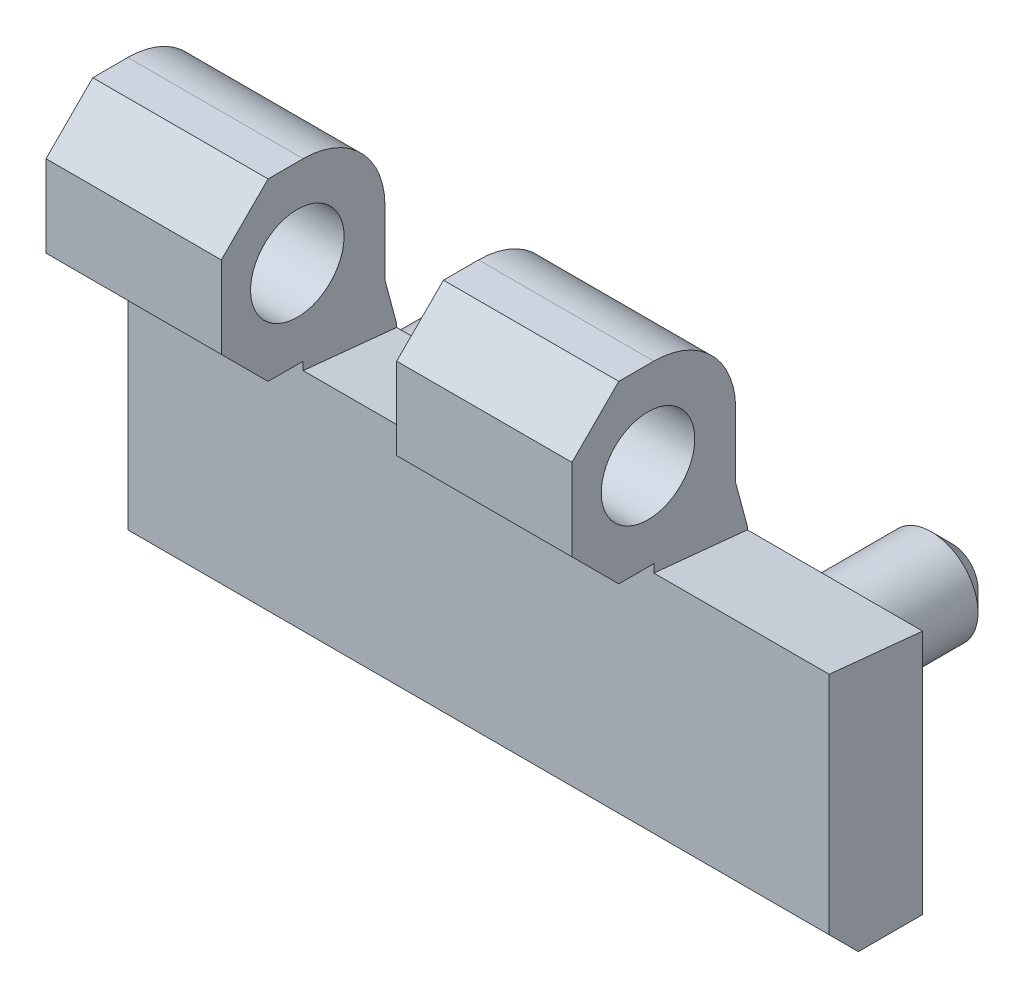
ISO-10303-21;
HEADER;
FILE_DESCRIPTION(('STEP AP214'),'2;1');
FILE_NAME('part.step','',(''),(''),'','','');
FILE_SCHEMA(('AUTOMOTIVE_DESIGN { 1 0 10303 214 1 1 1 1 }'));
ENDSEC;
DATA;
#1=APPLICATION_CONTEXT('core data for automotive mechanical design processes');
#2=APPLICATION_PROTOCOL_DEFINITION('international standard','automotive_design',2000,#1);
#3=PRODUCT_CONTEXT('',#1,'mechanical');
#4=PRODUCT('Part','Part','',(#3));
#5=PRODUCT_RELATED_PRODUCT_CATEGORY('part','',(#4));
#6=PRODUCT_DEFINITION_FORMATION('','',#4);
#7=PRODUCT_DEFINITION_CONTEXT('part definition',#1,'design');
#8=PRODUCT_DEFINITION('design','',#6,#7);
#9=PRODUCT_DEFINITION_SHAPE('','',#8);
#10=(LENGTH_UNIT() NAMED_UNIT(*) SI_UNIT(.MILLI.,.METRE.));
#11=(NAMED_UNIT(*) PLANE_ANGLE_UNIT() SI_UNIT($,.RADIAN.));
#12=(NAMED_UNIT(*) SI_UNIT($,.STERADIAN.) SOLID_ANGLE_UNIT());
#13=UNCERTAINTY_MEASURE_WITH_UNIT(LENGTH_MEASURE(1.E-05),#10,'distance_accuracy_value','');
#14=(GEOMETRIC_REPRESENTATION_CONTEXT(3) GLOBAL_UNCERTAINTY_ASSIGNED_CONTEXT((#13)) GLOBAL_UNIT_ASSIGNED_CONTEXT((#10,
#11,#12)) REPRESENTATION_CONTEXT('',''));
#15=CARTESIAN_POINT('',(0.,0.,0.));
#16=DIRECTION('',(0.,0.,1.));
#17=DIRECTION('',(1.,0.,0.));
#18=AXIS2_PLACEMENT_3D('',#15,#16,#17);
#19=CARTESIAN_POINT('',(-12.,9.,0.));
#20=DIRECTION('',(0.,0.995037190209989,-0.0995037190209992));
#21=DIRECTION('',(0.,0.0995037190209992,0.995037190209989));
#22=AXIS2_PLACEMENT_3D('',#19,#20,#21);
#23=PLANE('',#22);
#24=DIRECTION('',(0.,-0.0995037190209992,-0.995037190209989));
#25=VECTOR('',#24,1.);
#26=CARTESIAN_POINT('',(3.,9.,0.));
#27=LINE('',#26,#25);
#28=CARTESIAN_POINT('',(3.,9.8,8.));
#29=VERTEX_POINT('',#28);
#30=CARTESIAN_POINT('',(3.,9.,0.));
#31=VERTEX_POINT('',#30);
#32=EDGE_CURVE('E29',#29,#31,#27,.T.);
#33=ORIENTED_EDGE('',*,*,#32,.F.);
#34=DIRECTION('',(1.,0.,0.));
#35=VECTOR('',#34,1.);
#36=CARTESIAN_POINT('',(-12.,9.8,8.));
#37=LINE('',#36,#35);
#38=CARTESIAN_POINT('',(18.,9.8,8.));
#39=VERTEX_POINT('',#38);
#40=EDGE_CURVE('E403',#29,#39,#37,.T.);
#41=ORIENTED_EDGE('',*,*,#40,.T.);
#42=DIRECTION('',(0.,-0.0995037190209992,-0.995037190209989));
#43=VECTOR('',#42,1.);
#44=CARTESIAN_POINT('',(18.,9.,0.));
#45=LINE('',#44,#43);
#46=CARTESIAN_POINT('',(18.,9.,0.));
#47=VERTEX_POINT('',#46);
#48=EDGE_CURVE('E369',#39,#47,#45,.T.);
#49=ORIENTED_EDGE('',*,*,#48,.T.);
#50=DIRECTION('',(1.,0.,0.));
#51=VECTOR('',#50,1.);
#52=CARTESIAN_POINT('',(-12.,9.,0.));
#53=LINE('',#52,#51);
#54=EDGE_CURVE('E36',#31,#47,#53,.T.);
#55=ORIENTED_EDGE('',*,*,#54,.F.);
#56=EDGE_LOOP('',(#33,#41,#49,#55));
#57=FACE_BOUND('',#56,.T.);
#58=ADVANCED_FACE('F14',(#57),#23,.T.);
#59=CARTESIAN_POINT('',(-12.,-12.,5.5));
#60=DIRECTION('',(0.,-1.,0.));
#61=DIRECTION('',(1.,0.,0.));
#62=AXIS2_PLACEMENT_3D('',#59,#60,#61);
#63=PLANE('',#62);
#64=DIRECTION('',(1.,0.,0.));
#65=VECTOR('',#64,1.);
#66=CARTESIAN_POINT('',(-12.,-12.,0.));
#67=LINE('',#66,#65);
#68=CARTESIAN_POINT('',(-12.,-12.,0.));
#69=VERTEX_POINT('',#68);
#70=CARTESIAN_POINT('',(48.,-12.,0.));
#71=VERTEX_POINT('',#70);
#72=EDGE_CURVE('E407',#69,#71,#67,.T.);
#73=ORIENTED_EDGE('',*,*,#72,.T.);
#74=DIRECTION('',(0.,0.,-1.));
#75=VECTOR('',#74,1.);
#76=CARTESIAN_POINT('',(48.,-12.,5.5));
#77=LINE('',#76,#75);
#78=CARTESIAN_POINT('',(48.,-12.,5.5));
#79=VERTEX_POINT('',#78);
#80=EDGE_CURVE('E374',#79,#71,#77,.T.);
#81=ORIENTED_EDGE('',*,*,#80,.F.);
#82=DIRECTION('',(1.,0.,0.));
#83=VECTOR('',#82,1.);
#84=CARTESIAN_POINT('',(-12.,-12.,5.5));
#85=LINE('',#84,#83);
#86=CARTESIAN_POINT('',(-12.,-12.,5.5));
#87=VERTEX_POINT('',#86);
#88=EDGE_CURVE('E396',#87,#79,#85,.T.);
#89=ORIENTED_EDGE('',*,*,#88,.F.);
#90=DIRECTION('',(0.,0.,-1.));
#91=VECTOR('',#90,1.);
#92=CARTESIAN_POINT('',(-12.,-12.,5.5));
#93=LINE('',#92,#91);
#94=EDGE_CURVE('E387',#87,#69,#93,.T.);
#95=ORIENTED_EDGE('',*,*,#94,.T.);
#96=EDGE_LOOP('',(#73,#81,#89,#95));
#97=FACE_BOUND('',#96,.T.);
#98=ADVANCED_FACE('F16',(#97),#63,.T.);
#99=CARTESIAN_POINT('',(-12.,-12.,0.));
#100=DIRECTION('',(0.,0.,-1.));
#101=DIRECTION('',(-1.,0.,0.));
#102=AXIS2_PLACEMENT_3D('',#99,#100,#101);
#103=PLANE('',#102);
#104=CARTESIAN_POINT('',(0.,0.,0.));
#105=DIRECTION('',(0.,0.,-1.));
#106=DIRECTION('',(-1.,0.,0.));
#107=AXIS2_PLACEMENT_3D('',#104,#105,#106);
#108=CIRCLE('',#107,4.);
#109=CARTESIAN_POINT('',(-4.,0.,0.));
#110=VERTEX_POINT('',#109);
#111=EDGE_CURVE('E9',#110,#110,#108,.T.);
#112=ORIENTED_EDGE('',*,*,#111,.F.);
#113=EDGE_LOOP('',(#112));
#114=FACE_BOUND('',#113,.T.);
#115=CARTESIAN_POINT('',(36.,0.,0.));
#116=DIRECTION('',(0.,0.,-1.));
#117=DIRECTION('',(-1.,0.,0.));
#118=AXIS2_PLACEMENT_3D('',#115,#116,#117);
#119=CIRCLE('',#118,4.);
#120=CARTESIAN_POINT('',(32.,0.,0.));
#121=VERTEX_POINT('',#120);
#122=EDGE_CURVE('E22',#121,#121,#119,.T.);
#123=ORIENTED_EDGE('',*,*,#122,.F.);
#124=EDGE_LOOP('',(#123));
#125=FACE_BOUND('',#124,.T.);
#126=DIRECTION('',(0.,1.,0.));
#127=VECTOR('',#126,1.);
#128=CARTESIAN_POINT('',(-12.,-12.,0.));
#129=LINE('',#128,#127);
#130=CARTESIAN_POINT('',(-12.,9.2679491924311,0.));
#131=VERTEX_POINT('',#130);
#132=EDGE_CURVE('E194',#69,#131,#129,.T.);
#133=ORIENTED_EDGE('',*,*,#132,.T.);
#134=DIRECTION('',(1.,0.,0.));
#135=VECTOR('',#134,1.);
#136=CARTESIAN_POINT('',(-12.,9.2679491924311,0.));
#137=LINE('',#136,#135);
#138=CARTESIAN_POINT('',(3.,9.2679491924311,0.));
#139=VERTEX_POINT('',#138);
#140=EDGE_CURVE('E191',#131,#139,#137,.T.);
#141=ORIENTED_EDGE('',*,*,#140,.T.);
#142=DIRECTION('',(0.,1.,0.));
#143=VECTOR('',#142,1.);
#144=CARTESIAN_POINT('',(3.,2.,0.));
#145=LINE('',#144,#143);
#146=EDGE_CURVE('E180',#31,#139,#145,.T.);
#147=ORIENTED_EDGE('',*,*,#146,.F.);
#148=ORIENTED_EDGE('',*,*,#54,.T.);
#149=DIRECTION('',(0.,1.,0.));
#150=VECTOR('',#149,1.);
#151=CARTESIAN_POINT('',(18.,2.,0.));
#152=LINE('',#151,#150);
#153=CARTESIAN_POINT('',(18.,9.2679491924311,0.));
#154=VERTEX_POINT('',#153);
#155=EDGE_CURVE('E284',#47,#154,#152,.T.);
#156=ORIENTED_EDGE('',*,*,#155,.T.);
#157=DIRECTION('',(-1.,0.,0.));
#158=VECTOR('',#157,1.);
#159=CARTESIAN_POINT('',(33.,9.2679491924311,0.));
#160=LINE('',#159,#158);
#161=CARTESIAN_POINT('',(33.,9.2679491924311,0.));
#162=VERTEX_POINT('',#161);
#163=EDGE_CURVE('E366',#162,#154,#160,.T.);
#164=ORIENTED_EDGE('',*,*,#163,.F.);
#165=DIRECTION('',(0.,1.,0.));
#166=VECTOR('',#165,1.);
#167=CARTESIAN_POINT('',(33.,2.,0.));
#168=LINE('',#167,#166);
#169=CARTESIAN_POINT('',(33.,9.,0.));
#170=VERTEX_POINT('',#169);
#171=EDGE_CURVE('E319',#170,#162,#168,.T.);
#172=ORIENTED_EDGE('',*,*,#171,.F.);
#173=CARTESIAN_POINT('',(48.,9.,0.));
#174=VERTEX_POINT('',#173);
#175=EDGE_CURVE('E405',#170,#174,#53,.T.);
#176=ORIENTED_EDGE('',*,*,#175,.T.);
#177=DIRECTION('',(0.,1.,0.));
#178=VECTOR('',#177,1.);
#179=CARTESIAN_POINT('',(48.,-12.,0.));
#180=LINE('',#179,#178);
#181=EDGE_CURVE('E375',#71,#174,#180,.T.);
#182=ORIENTED_EDGE('',*,*,#181,.F.);
#183=ORIENTED_EDGE('',*,*,#72,.F.);
#184=EDGE_LOOP('',(#133,#141,#147,#148,#156,#164,#172,#176,#182,#183));
#185=FACE_BOUND('',#184,.T.);
#186=ADVANCED_FACE('F192',(#114,#125,#185),#103,.T.);
#187=DIRECTION('',(0.,-0.0995037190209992,-0.995037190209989));
#188=VECTOR('',#187,1.);
#189=CARTESIAN_POINT('',(33.,9.,0.));
#190=LINE('',#189,#188);
#191=CARTESIAN_POINT('',(33.,9.8,8.));
#192=VERTEX_POINT('',#191);
#193=EDGE_CURVE('E372',#192,#170,#190,.T.);
#194=ORIENTED_EDGE('',*,*,#193,.F.);
#195=CARTESIAN_POINT('',(48.,9.8,8.));
#196=VERTEX_POINT('',#195);
#197=EDGE_CURVE('E402',#192,#196,#37,.T.);
#198=ORIENTED_EDGE('',*,*,#197,.T.);
#199=DIRECTION('',(0.,0.0995037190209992,0.995037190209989));
#200=VECTOR('',#199,1.);
#201=CARTESIAN_POINT('',(48.,9.,0.));
#202=LINE('',#201,#200);
#203=EDGE_CURVE('E378',#174,#196,#202,.T.);
#204=ORIENTED_EDGE('',*,*,#203,.F.);
#205=ORIENTED_EDGE('',*,*,#175,.F.);
#206=EDGE_LOOP('',(#194,#198,#204,#205));
#207=FACE_BOUND('',#206,.T.);
#208=ADVANCED_FACE('F414',(#207),#23,.T.);
#209=CARTESIAN_POINT('',(-12.,9.8,8.));
#210=DIRECTION('',(0.,0.,1.));
#211=DIRECTION('',(1.,0.,0.));
#212=AXIS2_PLACEMENT_3D('',#209,#210,#211);
#213=PLANE('',#212);
#214=DIRECTION('',(0.,-1.,0.));
#215=VECTOR('',#214,1.);
#216=CARTESIAN_POINT('',(-12.,9.8,8.));
#217=LINE('',#216,#215);
#218=CARTESIAN_POINT('',(-12.,10.5,8.));
#219=VERTEX_POINT('',#218);
#220=CARTESIAN_POINT('',(-12.,-9.5,8.));
#221=VERTEX_POINT('',#220);
#222=EDGE_CURVE('E391',#219,#221,#217,.T.);
#223=ORIENTED_EDGE('',*,*,#222,.T.);
#224=DIRECTION('',(1.,0.,0.));
#225=VECTOR('',#224,1.);
#226=CARTESIAN_POINT('',(-12.,-9.5,8.));
#227=LINE('',#226,#225);
#228=CARTESIAN_POINT('',(48.,-9.5,8.));
#229=VERTEX_POINT('',#228);
#230=EDGE_CURVE('E400',#221,#229,#227,.T.);
#231=ORIENTED_EDGE('',*,*,#230,.T.);
#232=DIRECTION('',(0.,-1.,0.));
#233=VECTOR('',#232,1.);
#234=CARTESIAN_POINT('',(48.,9.8,8.));
#235=LINE('',#234,#233);
#236=EDGE_CURVE('E381',#196,#229,#235,.T.);
#237=ORIENTED_EDGE('',*,*,#236,.F.);
#238=ORIENTED_EDGE('',*,*,#197,.F.);
#239=DIRECTION('',(0.,-1.,0.));
#240=VECTOR('',#239,1.);
#241=CARTESIAN_POINT('',(33.,10.5,8.));
#242=LINE('',#241,#240);
#243=CARTESIAN_POINT('',(33.,10.5,8.));
#244=VERTEX_POINT('',#243);
#245=EDGE_CURVE('E337',#244,#192,#242,.T.);
#246=ORIENTED_EDGE('',*,*,#245,.F.);
#247=DIRECTION('',(-1.,0.,0.));
#248=VECTOR('',#247,1.);
#249=CARTESIAN_POINT('',(33.,10.5,8.));
#250=LINE('',#249,#248);
#251=CARTESIAN_POINT('',(18.,10.5,8.));
#252=VERTEX_POINT('',#251);
#253=EDGE_CURVE('E342',#244,#252,#250,.T.);
#254=ORIENTED_EDGE('',*,*,#253,.T.);
#255=DIRECTION('',(0.,-1.,0.));
#256=VECTOR('',#255,1.);
#257=CARTESIAN_POINT('',(18.,10.5,8.));
#258=LINE('',#257,#256);
#259=EDGE_CURVE('E311',#252,#39,#258,.T.);
#260=ORIENTED_EDGE('',*,*,#259,.T.);
#261=ORIENTED_EDGE('',*,*,#40,.F.);
#262=DIRECTION('',(0.,-1.,0.));
#263=VECTOR('',#262,1.);
#264=CARTESIAN_POINT('',(3.,10.5,8.));
#265=LINE('',#264,#263);
#266=CARTESIAN_POINT('',(3.,10.5,8.));
#267=VERTEX_POINT('',#266);
#268=EDGE_CURVE('E235',#267,#29,#265,.T.);
#269=ORIENTED_EDGE('',*,*,#268,.F.);
#270=DIRECTION('',(1.,0.,0.));
#271=VECTOR('',#270,1.);
#272=CARTESIAN_POINT('',(-12.,10.5,8.));
#273=LINE('',#272,#271);
#274=EDGE_CURVE('E268',#219,#267,#273,.T.);
#275=ORIENTED_EDGE('',*,*,#274,.F.);
#276=EDGE_LOOP('',(#223,#231,#237,#238,#246,#254,#260,#261,#269,#275));
#277=FACE_BOUND('',#276,.T.);
#278=ADVANCED_FACE('F422',(#277),#213,.T.);
#279=CARTESIAN_POINT('',(-12.,-9.5,8.));
#280=DIRECTION('',(0.,-0.707106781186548,0.707106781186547));
#281=DIRECTION('',(0.,-0.707106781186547,-0.707106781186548));
#282=AXIS2_PLACEMENT_3D('',#279,#280,#281);
#283=PLANE('',#282);
#284=ORIENTED_EDGE('',*,*,#88,.T.);
#285=DIRECTION('',(0.,-0.707106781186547,-0.707106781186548));
#286=VECTOR('',#285,1.);
#287=CARTESIAN_POINT('',(48.,-9.5,8.));
#288=LINE('',#287,#286);
#289=EDGE_CURVE('E384',#229,#79,#288,.T.);
#290=ORIENTED_EDGE('',*,*,#289,.F.);
#291=ORIENTED_EDGE('',*,*,#230,.F.);
#292=DIRECTION('',(0.,-0.707106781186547,-0.707106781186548));
#293=VECTOR('',#292,1.);
#294=CARTESIAN_POINT('',(-12.,-9.5,8.));
#295=LINE('',#294,#293);
#296=EDGE_CURVE('E393',#221,#87,#295,.T.);
#297=ORIENTED_EDGE('',*,*,#296,.T.);
#298=EDGE_LOOP('',(#284,#290,#291,#297));
#299=FACE_BOUND('',#298,.T.);
#300=ADVANCED_FACE('F434',(#299),#283,.T.);
#301=CARTESIAN_POINT('',(-12.,-12.,0.));
#302=DIRECTION('',(1.,0.,0.));
#303=DIRECTION('',(0.,1.,0.));
#304=AXIS2_PLACEMENT_3D('',#301,#302,#303);
#305=PLANE('',#304);
#306=ORIENTED_EDGE('',*,*,#296,.F.);
#307=ORIENTED_EDGE('',*,*,#222,.F.);
#308=DIRECTION('',(0.,0.,-1.));
#309=VECTOR('',#308,1.);
#310=CARTESIAN_POINT('',(-12.,10.5,11.));
#311=LINE('',#310,#309);
#312=CARTESIAN_POINT('',(-12.,10.5,11.));
#313=VERTEX_POINT('',#312);
#314=EDGE_CURVE('E262',#313,#219,#311,.T.);
#315=ORIENTED_EDGE('',*,*,#314,.F.);
#316=DIRECTION('',(0.,-0.707106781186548,-0.707106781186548));
#317=VECTOR('',#316,1.);
#318=CARTESIAN_POINT('',(-12.,14.5,15.));
#319=LINE('',#318,#317);
#320=CARTESIAN_POINT('',(-12.,14.5,15.));
#321=VERTEX_POINT('',#320);
#322=EDGE_CURVE('E259',#321,#313,#319,.T.);
#323=ORIENTED_EDGE('',*,*,#322,.F.);
#324=DIRECTION('',(0.,-1.,0.));
#325=VECTOR('',#324,1.);
#326=CARTESIAN_POINT('',(-12.,21.5,15.));
#327=LINE('',#326,#325);
#328=CARTESIAN_POINT('',(-12.,21.5,15.));
#329=VERTEX_POINT('',#328);
#330=EDGE_CURVE('E256',#329,#321,#327,.T.);
#331=ORIENTED_EDGE('',*,*,#330,.F.);
#332=DIRECTION('',(0.,-0.707106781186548,0.707106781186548));
#333=VECTOR('',#332,1.);
#334=CARTESIAN_POINT('',(-12.,25.5,11.));
#335=LINE('',#334,#333);
#336=CARTESIAN_POINT('',(-12.,25.5,11.));
#337=VERTEX_POINT('',#336);
#338=EDGE_CURVE('E253',#337,#329,#335,.T.);
#339=ORIENTED_EDGE('',*,*,#338,.F.);
#340=DIRECTION('',(0.,0.,1.));
#341=VECTOR('',#340,1.);
#342=CARTESIAN_POINT('',(-12.,25.5,8.));
#343=LINE('',#342,#341);
#344=CARTESIAN_POINT('',(-12.,25.5,8.00000000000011));
#345=VERTEX_POINT('',#344);
#346=EDGE_CURVE('E250',#345,#337,#343,.T.);
#347=ORIENTED_EDGE('',*,*,#346,.F.);
#348=CARTESIAN_POINT('',(-12.,18.5,8.00000000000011));
#349=DIRECTION('',(1.,0.,0.));
#350=DIRECTION('',(0.,-1.,0.));
#351=AXIS2_PLACEMENT_3D('',#348,#349,#350);
#352=CIRCLE('',#351,7.00000000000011);
#353=CARTESIAN_POINT('',(-12.,18.5,1.));
#354=VERTEX_POINT('',#353);
#355=EDGE_CURVE('E247',#354,#345,#352,.T.);
#356=ORIENTED_EDGE('',*,*,#355,.F.);
#357=DIRECTION('',(0.,1.,0.));
#358=VECTOR('',#357,1.);
#359=CARTESIAN_POINT('',(-12.,13.,1.));
#360=LINE('',#359,#358);
#361=CARTESIAN_POINT('',(-12.,13.,1.));
#362=VERTEX_POINT('',#361);
#363=EDGE_CURVE('E244',#362,#354,#360,.T.);
#364=ORIENTED_EDGE('',*,*,#363,.F.);
#365=DIRECTION('',(0.,0.965925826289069,0.258819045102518));
#366=VECTOR('',#365,1.);
#367=CARTESIAN_POINT('',(-12.,9.2679491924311,0.));
#368=LINE('',#367,#366);
#369=EDGE_CURVE('E242',#131,#362,#368,.T.);
#370=ORIENTED_EDGE('',*,*,#369,.F.);
#371=ORIENTED_EDGE('',*,*,#132,.F.);
#372=ORIENTED_EDGE('',*,*,#94,.F.);
#373=EDGE_LOOP('',(#306,#307,#315,#323,#331,#339,#347,#356,#364,#370,#371,#372));
#374=FACE_BOUND('',#373,.T.);
#375=CARTESIAN_POINT('',(-12.,18.,8.5));
#376=DIRECTION('',(1.,0.,0.));
#377=DIRECTION('',(0.,1.,0.));
#378=AXIS2_PLACEMENT_3D('',#375,#376,#377);
#379=CIRCLE('',#378,4.);
#380=CARTESIAN_POINT('',(-12.,22.,8.5));
#381=VERTEX_POINT('',#380);
#382=EDGE_CURVE('E265',#381,#381,#379,.T.);
#383=ORIENTED_EDGE('',*,*,#382,.T.);
#384=EDGE_LOOP('',(#383));
#385=FACE_BOUND('',#384,.T.);
#386=ADVANCED_FACE('F438',(#374,#385),#305,.F.);
#387=CARTESIAN_POINT('',(48.,-12.,0.));
#388=DIRECTION('',(1.,0.,0.));
#389=DIRECTION('',(0.,1.,0.));
#390=AXIS2_PLACEMENT_3D('',#387,#388,#389);
#391=PLANE('',#390);
#392=ORIENTED_EDGE('',*,*,#80,.T.);
#393=ORIENTED_EDGE('',*,*,#181,.T.);
#394=ORIENTED_EDGE('',*,*,#203,.T.);
#395=ORIENTED_EDGE('',*,*,#236,.T.);
#396=ORIENTED_EDGE('',*,*,#289,.T.);
#397=EDGE_LOOP('',(#392,#393,#394,#395,#396));
#398=FACE_BOUND('',#397,.T.);
#399=ADVANCED_FACE('F442',(#398),#391,.T.);
#400=CARTESIAN_POINT('',(33.,9.2679491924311,0.));
#401=DIRECTION('',(0.,-0.258819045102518,0.965925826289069));
#402=DIRECTION('',(0.,-0.965925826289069,-0.258819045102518));
#403=AXIS2_PLACEMENT_3D('',#400,#401,#402);
#404=PLANE('',#403);
#405=DIRECTION('',(0.,0.965925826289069,0.258819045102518));
#406=VECTOR('',#405,1.);
#407=CARTESIAN_POINT('',(18.,9.2679491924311,0.));
#408=LINE('',#407,#406);
#409=CARTESIAN_POINT('',(18.,13.,1.));
#410=VERTEX_POINT('',#409);
#411=EDGE_CURVE('E287',#154,#410,#408,.T.);
#412=ORIENTED_EDGE('',*,*,#411,.T.);
#413=DIRECTION('',(-1.,0.,0.));
#414=VECTOR('',#413,1.);
#415=CARTESIAN_POINT('',(33.,13.,1.));
#416=LINE('',#415,#414);
#417=CARTESIAN_POINT('',(33.,13.,1.));
#418=VERTEX_POINT('',#417);
#419=EDGE_CURVE('E363',#418,#410,#416,.T.);
#420=ORIENTED_EDGE('',*,*,#419,.F.);
#421=DIRECTION('',(0.,0.965925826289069,0.258819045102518));
#422=VECTOR('',#421,1.);
#423=CARTESIAN_POINT('',(33.,9.2679491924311,0.));
#424=LINE('',#423,#422);
#425=EDGE_CURVE('E321',#162,#418,#424,.T.);
#426=ORIENTED_EDGE('',*,*,#425,.F.);
#427=ORIENTED_EDGE('',*,*,#163,.T.);
#428=EDGE_LOOP('',(#412,#420,#426,#427));
#429=FACE_BOUND('',#428,.T.);
#430=ADVANCED_FACE('F446',(#429),#404,.F.);
#431=CARTESIAN_POINT('',(33.,13.,1.));
#432=DIRECTION('',(0.,0.,1.));
#433=DIRECTION('',(1.,0.,0.));
#434=AXIS2_PLACEMENT_3D('',#431,#432,#433);
#435=PLANE('',#434);
#436=DIRECTION('',(0.,1.,0.));
#437=VECTOR('',#436,1.);
#438=CARTESIAN_POINT('',(18.,13.,1.));
#439=LINE('',#438,#437);
#440=CARTESIAN_POINT('',(18.,18.5,1.));
#441=VERTEX_POINT('',#440);
#442=EDGE_CURVE('E290',#410,#441,#439,.T.);
#443=ORIENTED_EDGE('',*,*,#442,.T.);
#444=DIRECTION('',(-1.,0.,0.));
#445=VECTOR('',#444,1.);
#446=CARTESIAN_POINT('',(33.,18.5,1.));
#447=LINE('',#446,#445);
#448=CARTESIAN_POINT('',(33.,18.5,1.));
#449=VERTEX_POINT('',#448);
#450=EDGE_CURVE('E360',#449,#441,#447,.T.);
#451=ORIENTED_EDGE('',*,*,#450,.F.);
#452=DIRECTION('',(0.,1.,0.));
#453=VECTOR('',#452,1.);
#454=CARTESIAN_POINT('',(33.,13.,1.));
#455=LINE('',#454,#453);
#456=EDGE_CURVE('E323',#418,#449,#455,.T.);
#457=ORIENTED_EDGE('',*,*,#456,.F.);
#458=ORIENTED_EDGE('',*,*,#419,.T.);
#459=EDGE_LOOP('',(#443,#451,#457,#458));
#460=FACE_BOUND('',#459,.T.);
#461=ADVANCED_FACE('F450',(#460),#435,.F.);
#462=CARTESIAN_POINT('',(33.,18.5,8.00000000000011));
#463=DIRECTION('',(-1.,0.,0.));
#464=DIRECTION('',(0.,-1.,0.));
#465=AXIS2_PLACEMENT_3D('',#462,#463,#464);
#466=CYLINDRICAL_SURFACE('',#465,7.00000000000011);
#467=CARTESIAN_POINT('',(18.,18.5,8.00000000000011));
#468=DIRECTION('',(1.,0.,0.));
#469=DIRECTION('',(0.,-1.,0.));
#470=AXIS2_PLACEMENT_3D('',#467,#468,#469);
#471=CIRCLE('',#470,7.00000000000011);
#472=CARTESIAN_POINT('',(18.,25.5,8.00000000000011));
#473=VERTEX_POINT('',#472);
#474=EDGE_CURVE('E293',#441,#473,#471,.T.);
#475=ORIENTED_EDGE('',*,*,#474,.T.);
#476=DIRECTION('',(-1.,0.,0.));
#477=VECTOR('',#476,1.);
#478=CARTESIAN_POINT('',(33.,25.5,8.00000000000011));
#479=LINE('',#478,#477);
#480=CARTESIAN_POINT('',(33.,25.5,8.00000000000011));
#481=VERTEX_POINT('',#480);
#482=EDGE_CURVE('E357',#481,#473,#479,.T.);
#483=ORIENTED_EDGE('',*,*,#482,.F.);
#484=CARTESIAN_POINT('',(33.,18.5,8.00000000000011));
#485=DIRECTION('',(1.,0.,0.));
#486=DIRECTION('',(0.,-1.,0.));
#487=AXIS2_PLACEMENT_3D('',#484,#485,#486);
#488=CIRCLE('',#487,7.00000000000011);
#489=EDGE_CURVE('E325',#449,#481,#488,.T.);
#490=ORIENTED_EDGE('',*,*,#489,.F.);
#491=ORIENTED_EDGE('',*,*,#450,.T.);
#492=EDGE_LOOP('',(#475,#483,#490,#491));
#493=FACE_BOUND('',#492,.T.);
#494=ADVANCED_FACE('F454',(#493),#466,.T.);
#495=CARTESIAN_POINT('',(33.,25.5,8.));
#496=DIRECTION('',(0.,-1.,0.));
#497=DIRECTION('',(1.,0.,0.));
#498=AXIS2_PLACEMENT_3D('',#495,#496,#497);
#499=PLANE('',#498);
#500=DIRECTION('',(0.,0.,1.));
#501=VECTOR('',#500,1.);
#502=CARTESIAN_POINT('',(18.,25.5,8.));
#503=LINE('',#502,#501);
#504=CARTESIAN_POINT('',(18.,25.5,11.));
#505=VERTEX_POINT('',#504);
#506=EDGE_CURVE('E296',#473,#505,#503,.T.);
#507=ORIENTED_EDGE('',*,*,#506,.T.);
#508=DIRECTION('',(-1.,0.,0.));
#509=VECTOR('',#508,1.);
#510=CARTESIAN_POINT('',(33.,25.5,11.));
#511=LINE('',#510,#509);
#512=CARTESIAN_POINT('',(33.,25.5,11.));
#513=VERTEX_POINT('',#512);
#514=EDGE_CURVE('E354',#513,#505,#511,.T.);
#515=ORIENTED_EDGE('',*,*,#514,.F.);
#516=DIRECTION('',(0.,0.,1.));
#517=VECTOR('',#516,1.);
#518=CARTESIAN_POINT('',(33.,25.5,8.));
#519=LINE('',#518,#517);
#520=EDGE_CURVE('E327',#481,#513,#519,.T.);
#521=ORIENTED_EDGE('',*,*,#520,.F.);
#522=ORIENTED_EDGE('',*,*,#482,.T.);
#523=EDGE_LOOP('',(#507,#515,#521,#522));
#524=FACE_BOUND('',#523,.T.);
#525=ADVANCED_FACE('F458',(#524),#499,.F.);
#526=CARTESIAN_POINT('',(33.,25.5,11.));
#527=DIRECTION('',(0.,-0.707106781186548,-0.707106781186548));
#528=DIRECTION('',(0.,0.707106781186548,-0.707106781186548));
#529=AXIS2_PLACEMENT_3D('',#526,#527,#528);
#530=PLANE('',#529);
#531=DIRECTION('',(0.,-0.707106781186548,0.707106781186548));
#532=VECTOR('',#531,1.);
#533=CARTESIAN_POINT('',(18.,25.5,11.));
#534=LINE('',#533,#532);
#535=CARTESIAN_POINT('',(18.,21.5,15.));
#536=VERTEX_POINT('',#535);
#537=EDGE_CURVE('E299',#505,#536,#534,.T.);
#538=ORIENTED_EDGE('',*,*,#537,.T.);
#539=DIRECTION('',(-1.,0.,0.));
#540=VECTOR('',#539,1.);
#541=CARTESIAN_POINT('',(33.,21.5,15.));
#542=LINE('',#541,#540);
#543=CARTESIAN_POINT('',(33.,21.5,15.));
#544=VERTEX_POINT('',#543);
#545=EDGE_CURVE('E351',#544,#536,#542,.T.);
#546=ORIENTED_EDGE('',*,*,#545,.F.);
#547=DIRECTION('',(0.,-0.707106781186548,0.707106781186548));
#548=VECTOR('',#547,1.);
#549=CARTESIAN_POINT('',(33.,25.5,11.));
#550=LINE('',#549,#548);
#551=EDGE_CURVE('E329',#513,#544,#550,.T.);
#552=ORIENTED_EDGE('',*,*,#551,.F.);
#553=ORIENTED_EDGE('',*,*,#514,.T.);
#554=EDGE_LOOP('',(#538,#546,#552,#553));
#555=FACE_BOUND('',#554,.T.);
#556=ADVANCED_FACE('F462',(#555),#530,.F.);
#557=CARTESIAN_POINT('',(33.,21.5,15.));
#558=DIRECTION('',(0.,0.,-1.));
#559=DIRECTION('',(-1.,0.,0.));
#560=AXIS2_PLACEMENT_3D('',#557,#558,#559);
#561=PLANE('',#560);
#562=DIRECTION('',(0.,-1.,0.));
#563=VECTOR('',#562,1.);
#564=CARTESIAN_POINT('',(18.,21.5,15.));
#565=LINE('',#564,#563);
#566=CARTESIAN_POINT('',(18.,14.5,15.));
#567=VERTEX_POINT('',#566);
#568=EDGE_CURVE('E302',#536,#567,#565,.T.);
#569=ORIENTED_EDGE('',*,*,#568,.T.);
#570=DIRECTION('',(-1.,0.,0.));
#571=VECTOR('',#570,1.);
#572=CARTESIAN_POINT('',(33.,14.5,15.));
#573=LINE('',#572,#571);
#574=CARTESIAN_POINT('',(33.,14.5,15.));
#575=VERTEX_POINT('',#574);
#576=EDGE_CURVE('E348',#575,#567,#573,.T.);
#577=ORIENTED_EDGE('',*,*,#576,.F.);
#578=DIRECTION('',(0.,-1.,0.));
#579=VECTOR('',#578,1.);
#580=CARTESIAN_POINT('',(33.,21.5,15.));
#581=LINE('',#580,#579);
#582=EDGE_CURVE('E331',#544,#575,#581,.T.);
#583=ORIENTED_EDGE('',*,*,#582,.F.);
#584=ORIENTED_EDGE('',*,*,#545,.T.);
#585=EDGE_LOOP('',(#569,#577,#583,#584));
#586=FACE_BOUND('',#585,.T.);
#587=ADVANCED_FACE('F466',(#586),#561,.F.);
#588=CARTESIAN_POINT('',(33.,14.5,15.));
#589=DIRECTION('',(0.,0.707106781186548,-0.707106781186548));
#590=DIRECTION('',(0.,0.707106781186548,0.707106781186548));
#591=AXIS2_PLACEMENT_3D('',#588,#589,#590);
#592=PLANE('',#591);
#593=DIRECTION('',(0.,-0.707106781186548,-0.707106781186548));
#594=VECTOR('',#593,1.);
#595=CARTESIAN_POINT('',(18.,14.5,15.));
#596=LINE('',#595,#594);
#597=CARTESIAN_POINT('',(18.,10.5,11.));
#598=VERTEX_POINT('',#597);
#599=EDGE_CURVE('E305',#567,#598,#596,.T.);
#600=ORIENTED_EDGE('',*,*,#599,.T.);
#601=DIRECTION('',(-1.,0.,0.));
#602=VECTOR('',#601,1.);
#603=CARTESIAN_POINT('',(33.,10.5,11.));
#604=LINE('',#603,#602);
#605=CARTESIAN_POINT('',(33.,10.5,11.));
#606=VERTEX_POINT('',#605);
#607=EDGE_CURVE('E345',#606,#598,#604,.T.);
#608=ORIENTED_EDGE('',*,*,#607,.F.);
#609=DIRECTION('',(0.,-0.707106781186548,-0.707106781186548));
#610=VECTOR('',#609,1.);
#611=CARTESIAN_POINT('',(33.,14.5,15.));
#612=LINE('',#611,#610);
#613=EDGE_CURVE('E333',#575,#606,#612,.T.);
#614=ORIENTED_EDGE('',*,*,#613,.F.);
#615=ORIENTED_EDGE('',*,*,#576,.T.);
#616=EDGE_LOOP('',(#600,#608,#614,#615));
#617=FACE_BOUND('',#616,.T.);
#618=ADVANCED_FACE('F470',(#617),#592,.F.);
#619=CARTESIAN_POINT('',(33.,10.5,11.));
#620=DIRECTION('',(0.,1.,0.));
#621=DIRECTION('',(-1.,0.,0.));
#622=AXIS2_PLACEMENT_3D('',#619,#620,#621);
#623=PLANE('',#622);
#624=DIRECTION('',(0.,0.,-1.));
#625=VECTOR('',#624,1.);
#626=CARTESIAN_POINT('',(18.,10.5,11.));
#627=LINE('',#626,#625);
#628=EDGE_CURVE('E308',#598,#252,#627,.T.);
#629=ORIENTED_EDGE('',*,*,#628,.T.);
#630=ORIENTED_EDGE('',*,*,#253,.F.);
#631=DIRECTION('',(0.,0.,-1.));
#632=VECTOR('',#631,1.);
#633=CARTESIAN_POINT('',(33.,10.5,11.));
#634=LINE('',#633,#632);
#635=EDGE_CURVE('E335',#606,#244,#634,.T.);
#636=ORIENTED_EDGE('',*,*,#635,.F.);
#637=ORIENTED_EDGE('',*,*,#607,.T.);
#638=EDGE_LOOP('',(#629,#630,#636,#637));
#639=FACE_BOUND('',#638,.T.);
#640=ADVANCED_FACE('F474',(#639),#623,.F.);
#641=CARTESIAN_POINT('',(33.,18.,8.5));
#642=DIRECTION('',(-1.,0.,0.));
#643=DIRECTION('',(0.,-1.,0.));
#644=AXIS2_PLACEMENT_3D('',#641,#642,#643);
#645=CYLINDRICAL_SURFACE('',#644,4.);
#646=CARTESIAN_POINT('',(33.,18.,8.5));
#647=DIRECTION('',(1.,0.,0.));
#648=DIRECTION('',(0.,1.,0.));
#649=AXIS2_PLACEMENT_3D('',#646,#647,#648);
#650=CIRCLE('',#649,4.);
#651=CARTESIAN_POINT('',(33.,22.,8.5));
#652=VERTEX_POINT('',#651);
#653=EDGE_CURVE('E339',#652,#652,#650,.T.);
#654=ORIENTED_EDGE('',*,*,#653,.T.);
#655=EDGE_LOOP('',(#654));
#656=FACE_BOUND('',#655,.T.);
#657=CARTESIAN_POINT('',(18.,18.,8.5));
#658=DIRECTION('',(1.,0.,0.));
#659=DIRECTION('',(0.,1.,0.));
#660=AXIS2_PLACEMENT_3D('',#657,#658,#659);
#661=CIRCLE('',#660,4.);
#662=CARTESIAN_POINT('',(18.,22.,8.5));
#663=VERTEX_POINT('',#662);
#664=EDGE_CURVE('E315',#663,#663,#661,.T.);
#665=ORIENTED_EDGE('',*,*,#664,.F.);
#666=EDGE_LOOP('',(#665));
#667=FACE_BOUND('',#666,.T.);
#668=ADVANCED_FACE('F478',(#656,#667),#645,.F.);
#669=CARTESIAN_POINT('',(33.,18.5,8.00000000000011));
#670=DIRECTION('',(1.,0.,0.));
#671=DIRECTION('',(0.,1.,0.));
#672=AXIS2_PLACEMENT_3D('',#669,#670,#671);
#673=PLANE('',#672);
#674=ORIENTED_EDGE('',*,*,#653,.F.);
#675=EDGE_LOOP('',(#674));
#676=FACE_BOUND('',#675,.T.);
#677=ORIENTED_EDGE('',*,*,#245,.T.);
#678=ORIENTED_EDGE('',*,*,#193,.T.);
#679=ORIENTED_EDGE('',*,*,#171,.T.);
#680=ORIENTED_EDGE('',*,*,#425,.T.);
#681=ORIENTED_EDGE('',*,*,#456,.T.);
#682=ORIENTED_EDGE('',*,*,#489,.T.);
#683=ORIENTED_EDGE('',*,*,#520,.T.);
#684=ORIENTED_EDGE('',*,*,#551,.T.);
#685=ORIENTED_EDGE('',*,*,#582,.T.);
#686=ORIENTED_EDGE('',*,*,#613,.T.);
#687=ORIENTED_EDGE('',*,*,#635,.T.);
#688=EDGE_LOOP('',(#677,#678,#679,#680,#681,#682,#683,#684,#685,#686,#687));
#689=FACE_BOUND('',#688,.T.);
#690=ADVANCED_FACE('F482',(#676,#689),#673,.T.);
#691=CARTESIAN_POINT('',(18.,18.5,8.00000000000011));
#692=DIRECTION('',(1.,0.,0.));
#693=DIRECTION('',(0.,1.,0.));
#694=AXIS2_PLACEMENT_3D('',#691,#692,#693);
#695=PLANE('',#694);
#696=ORIENTED_EDGE('',*,*,#48,.F.);
#697=ORIENTED_EDGE('',*,*,#259,.F.);
#698=ORIENTED_EDGE('',*,*,#628,.F.);
#699=ORIENTED_EDGE('',*,*,#599,.F.);
#700=ORIENTED_EDGE('',*,*,#568,.F.);
#701=ORIENTED_EDGE('',*,*,#537,.F.);
#702=ORIENTED_EDGE('',*,*,#506,.F.);
#703=ORIENTED_EDGE('',*,*,#474,.F.);
#704=ORIENTED_EDGE('',*,*,#442,.F.);
#705=ORIENTED_EDGE('',*,*,#411,.F.);
#706=ORIENTED_EDGE('',*,*,#155,.F.);
#707=EDGE_LOOP('',(#696,#697,#698,#699,#700,#701,#702,#703,#704,#705,#706));
#708=FACE_BOUND('',#707,.T.);
#709=ORIENTED_EDGE('',*,*,#664,.T.);
#710=EDGE_LOOP('',(#709));
#711=FACE_BOUND('',#710,.T.);
#712=ADVANCED_FACE('F486',(#708,#711),#695,.F.);
#713=CARTESIAN_POINT('',(-12.,9.2679491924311,0.));
#714=DIRECTION('',(0.,0.258819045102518,-0.965925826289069));
#715=DIRECTION('',(0.,0.965925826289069,0.258819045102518));
#716=AXIS2_PLACEMENT_3D('',#713,#714,#715);
#717=PLANE('',#716);
#718=DIRECTION('',(0.,0.965925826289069,0.258819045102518));
#719=VECTOR('',#718,1.);
#720=CARTESIAN_POINT('',(3.,9.2679491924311,0.));
#721=LINE('',#720,#719);
#722=CARTESIAN_POINT('',(3.,13.,1.));
#723=VERTEX_POINT('',#722);
#724=EDGE_CURVE('E186',#139,#723,#721,.T.);
#725=ORIENTED_EDGE('',*,*,#724,.F.);
#726=ORIENTED_EDGE('',*,*,#140,.F.);
#727=ORIENTED_EDGE('',*,*,#369,.T.);
#728=DIRECTION('',(1.,0.,0.));
#729=VECTOR('',#728,1.);
#730=CARTESIAN_POINT('',(-12.,13.,1.));
#731=LINE('',#730,#729);
#732=EDGE_CURVE('E198',#362,#723,#731,.T.);
#733=ORIENTED_EDGE('',*,*,#732,.T.);
#734=EDGE_LOOP('',(#725,#726,#727,#733));
#735=FACE_BOUND('',#734,.T.);
#736=ADVANCED_FACE('F200',(#735),#717,.T.);
#737=CARTESIAN_POINT('',(-12.,13.,1.));
#738=DIRECTION('',(0.,0.,-1.));
#739=DIRECTION('',(-1.,0.,0.));
#740=AXIS2_PLACEMENT_3D('',#737,#738,#739);
#741=PLANE('',#740);
#742=DIRECTION('',(0.,1.,0.));
#743=VECTOR('',#742,1.);
#744=CARTESIAN_POINT('',(3.,13.,1.));
#745=LINE('',#744,#743);
#746=CARTESIAN_POINT('',(3.,18.5,1.));
#747=VERTEX_POINT('',#746);
#748=EDGE_CURVE('E203',#723,#747,#745,.T.);
#749=ORIENTED_EDGE('',*,*,#748,.F.);
#750=ORIENTED_EDGE('',*,*,#732,.F.);
#751=ORIENTED_EDGE('',*,*,#363,.T.);
#752=DIRECTION('',(1.,0.,0.));
#753=VECTOR('',#752,1.);
#754=CARTESIAN_POINT('',(-12.,18.5,1.));
#755=LINE('',#754,#753);
#756=EDGE_CURVE('E280',#354,#747,#755,.T.);
#757=ORIENTED_EDGE('',*,*,#756,.T.);
#758=EDGE_LOOP('',(#749,#750,#751,#757));
#759=FACE_BOUND('',#758,.T.);
#760=ADVANCED_FACE('F493',(#759),#741,.T.);
#761=CARTESIAN_POINT('',(-12.,18.5,8.00000000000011));
#762=DIRECTION('',(1.,0.,0.));
#763=DIRECTION('',(0.,1.,0.));
#764=AXIS2_PLACEMENT_3D('',#761,#762,#763);
#765=CYLINDRICAL_SURFACE('',#764,7.00000000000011);
#766=CARTESIAN_POINT('',(3.,18.5,8.00000000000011));
#767=DIRECTION('',(1.,0.,0.));
#768=DIRECTION('',(0.,-1.,0.));
#769=AXIS2_PLACEMENT_3D('',#766,#767,#768);
#770=CIRCLE('',#769,7.00000000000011);
#771=CARTESIAN_POINT('',(3.,25.5,8.00000000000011));
#772=VERTEX_POINT('',#771);
#773=EDGE_CURVE('E208',#747,#772,#770,.T.);
#774=ORIENTED_EDGE('',*,*,#773,.F.);
#775=ORIENTED_EDGE('',*,*,#756,.F.);
#776=ORIENTED_EDGE('',*,*,#355,.T.);
#777=DIRECTION('',(1.,0.,0.));
#778=VECTOR('',#777,1.);
#779=CARTESIAN_POINT('',(-12.,25.5,8.00000000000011));
#780=LINE('',#779,#778);
#781=EDGE_CURVE('E278',#345,#772,#780,.T.);
#782=ORIENTED_EDGE('',*,*,#781,.T.);
#783=EDGE_LOOP('',(#774,#775,#776,#782));
#784=FACE_BOUND('',#783,.T.);
#785=ADVANCED_FACE('F496',(#784),#765,.T.);
#786=CARTESIAN_POINT('',(-12.,25.5,8.));
#787=DIRECTION('',(0.,1.,0.));
#788=DIRECTION('',(-1.,0.,0.));
#789=AXIS2_PLACEMENT_3D('',#786,#787,#788);
#790=PLANE('',#789);
#791=DIRECTION('',(0.,0.,1.));
#792=VECTOR('',#791,1.);
#793=CARTESIAN_POINT('',(3.,25.5,8.));
#794=LINE('',#793,#792);
#795=CARTESIAN_POINT('',(3.,25.5,11.));
#796=VERTEX_POINT('',#795);
#797=EDGE_CURVE('E215',#772,#796,#794,.T.);
#798=ORIENTED_EDGE('',*,*,#797,.F.);
#799=ORIENTED_EDGE('',*,*,#781,.F.);
#800=ORIENTED_EDGE('',*,*,#346,.T.);
#801=DIRECTION('',(1.,0.,0.));
#802=VECTOR('',#801,1.);
#803=CARTESIAN_POINT('',(-12.,25.5,11.));
#804=LINE('',#803,#802);
#805=EDGE_CURVE('E276',#337,#796,#804,.T.);
#806=ORIENTED_EDGE('',*,*,#805,.T.);
#807=EDGE_LOOP('',(#798,#799,#800,#806));
#808=FACE_BOUND('',#807,.T.);
#809=ADVANCED_FACE('F500',(#808),#790,.T.);
#810=CARTESIAN_POINT('',(-12.,25.5,11.));
#811=DIRECTION('',(0.,0.707106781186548,0.707106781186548));
#812=DIRECTION('',(0.,-0.707106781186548,0.707106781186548));
#813=AXIS2_PLACEMENT_3D('',#810,#811,#812);
#814=PLANE('',#813);
#815=DIRECTION('',(0.,-0.707106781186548,0.707106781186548));
#816=VECTOR('',#815,1.);
#817=CARTESIAN_POINT('',(3.,25.5,11.));
#818=LINE('',#817,#816);
#819=CARTESIAN_POINT('',(3.,21.5,15.));
#820=VERTEX_POINT('',#819);
#821=EDGE_CURVE('E219',#796,#820,#818,.T.);
#822=ORIENTED_EDGE('',*,*,#821,.F.);
#823=ORIENTED_EDGE('',*,*,#805,.F.);
#824=ORIENTED_EDGE('',*,*,#338,.T.);
#825=DIRECTION('',(1.,0.,0.));
#826=VECTOR('',#825,1.);
#827=CARTESIAN_POINT('',(-12.,21.5,15.));
#828=LINE('',#827,#826);
#829=EDGE_CURVE('E274',#329,#820,#828,.T.);
#830=ORIENTED_EDGE('',*,*,#829,.T.);
#831=EDGE_LOOP('',(#822,#823,#824,#830));
#832=FACE_BOUND('',#831,.T.);
#833=ADVANCED_FACE('F504',(#832),#814,.T.);
#834=CARTESIAN_POINT('',(-12.,21.5,15.));
#835=DIRECTION('',(0.,0.,1.));
#836=DIRECTION('',(1.,0.,0.));
#837=AXIS2_PLACEMENT_3D('',#834,#835,#836);
#838=PLANE('',#837);
#839=DIRECTION('',(0.,-1.,0.));
#840=VECTOR('',#839,1.);
#841=CARTESIAN_POINT('',(3.,21.5,15.));
#842=LINE('',#841,#840);
#843=CARTESIAN_POINT('',(3.,14.5,15.));
#844=VERTEX_POINT('',#843);
#845=EDGE_CURVE('E223',#820,#844,#842,.T.);
#846=ORIENTED_EDGE('',*,*,#845,.F.);
#847=ORIENTED_EDGE('',*,*,#829,.F.);
#848=ORIENTED_EDGE('',*,*,#330,.T.);
#849=DIRECTION('',(1.,0.,0.));
#850=VECTOR('',#849,1.);
#851=CARTESIAN_POINT('',(-12.,14.5,15.));
#852=LINE('',#851,#850);
#853=EDGE_CURVE('E272',#321,#844,#852,.T.);
#854=ORIENTED_EDGE('',*,*,#853,.T.);
#855=EDGE_LOOP('',(#846,#847,#848,#854));
#856=FACE_BOUND('',#855,.T.);
#857=ADVANCED_FACE('F508',(#856),#838,.T.);
#858=CARTESIAN_POINT('',(-12.,14.5,15.));
#859=DIRECTION('',(0.,-0.707106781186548,0.707106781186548));
#860=DIRECTION('',(0.,-0.707106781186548,-0.707106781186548));
#861=AXIS2_PLACEMENT_3D('',#858,#859,#860);
#862=PLANE('',#861);
#863=DIRECTION('',(0.,-0.707106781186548,-0.707106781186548));
#864=VECTOR('',#863,1.);
#865=CARTESIAN_POINT('',(3.,14.5,15.));
#866=LINE('',#865,#864);
#867=CARTESIAN_POINT('',(3.,10.5,11.));
#868=VERTEX_POINT('',#867);
#869=EDGE_CURVE('E227',#844,#868,#866,.T.);
#870=ORIENTED_EDGE('',*,*,#869,.F.);
#871=ORIENTED_EDGE('',*,*,#853,.F.);
#872=ORIENTED_EDGE('',*,*,#322,.T.);
#873=DIRECTION('',(1.,0.,0.));
#874=VECTOR('',#873,1.);
#875=CARTESIAN_POINT('',(-12.,10.5,11.));
#876=LINE('',#875,#874);
#877=EDGE_CURVE('E270',#313,#868,#876,.T.);
#878=ORIENTED_EDGE('',*,*,#877,.T.);
#879=EDGE_LOOP('',(#870,#871,#872,#878));
#880=FACE_BOUND('',#879,.T.);
#881=ADVANCED_FACE('F512',(#880),#862,.T.);
#882=CARTESIAN_POINT('',(-12.,10.5,11.));
#883=DIRECTION('',(0.,-1.,0.));
#884=DIRECTION('',(1.,0.,0.));
#885=AXIS2_PLACEMENT_3D('',#882,#883,#884);
#886=PLANE('',#885);
#887=DIRECTION('',(0.,0.,-1.));
#888=VECTOR('',#887,1.);
#889=CARTESIAN_POINT('',(3.,10.5,11.));
#890=LINE('',#889,#888);
#891=EDGE_CURVE('E231',#868,#267,#890,.T.);
#892=ORIENTED_EDGE('',*,*,#891,.F.);
#893=ORIENTED_EDGE('',*,*,#877,.F.);
#894=ORIENTED_EDGE('',*,*,#314,.T.);
#895=ORIENTED_EDGE('',*,*,#274,.T.);
#896=EDGE_LOOP('',(#892,#893,#894,#895));
#897=FACE_BOUND('',#896,.T.);
#898=ADVANCED_FACE('F516',(#897),#886,.T.);
#899=CARTESIAN_POINT('',(-12.,18.,8.5));
#900=DIRECTION('',(1.,0.,0.));
#901=DIRECTION('',(0.,1.,0.));
#902=AXIS2_PLACEMENT_3D('',#899,#900,#901);
#903=CYLINDRICAL_SURFACE('',#902,4.);
#904=ORIENTED_EDGE('',*,*,#382,.F.);
#905=EDGE_LOOP('',(#904));
#906=FACE_BOUND('',#905,.T.);
#907=CARTESIAN_POINT('',(3.,18.,8.5));
#908=DIRECTION('',(1.,0.,0.));
#909=DIRECTION('',(0.,1.,0.));
#910=AXIS2_PLACEMENT_3D('',#907,#908,#909);
#911=CIRCLE('',#910,4.);
#912=CARTESIAN_POINT('',(3.,22.,8.5));
#913=VERTEX_POINT('',#912);
#914=EDGE_CURVE('E238',#913,#913,#911,.T.);
#915=ORIENTED_EDGE('',*,*,#914,.T.);
#916=EDGE_LOOP('',(#915));
#917=FACE_BOUND('',#916,.T.);
#918=ADVANCED_FACE('F520',(#906,#917),#903,.F.);
#919=CARTESIAN_POINT('',(3.,18.5,8.00000000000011));
#920=DIRECTION('',(1.,0.,0.));
#921=DIRECTION('',(0.,1.,0.));
#922=AXIS2_PLACEMENT_3D('',#919,#920,#921);
#923=PLANE('',#922);
#924=ORIENTED_EDGE('',*,*,#914,.F.);
#925=EDGE_LOOP('',(#924));
#926=FACE_BOUND('',#925,.T.);
#927=ORIENTED_EDGE('',*,*,#268,.T.);
#928=ORIENTED_EDGE('',*,*,#32,.T.);
#929=ORIENTED_EDGE('',*,*,#146,.T.);
#930=ORIENTED_EDGE('',*,*,#724,.T.);
#931=ORIENTED_EDGE('',*,*,#748,.T.);
#932=ORIENTED_EDGE('',*,*,#773,.T.);
#933=ORIENTED_EDGE('',*,*,#797,.T.);
#934=ORIENTED_EDGE('',*,*,#821,.T.);
#935=ORIENTED_EDGE('',*,*,#845,.T.);
#936=ORIENTED_EDGE('',*,*,#869,.T.);
#937=ORIENTED_EDGE('',*,*,#891,.T.);
#938=EDGE_LOOP('',(#927,#928,#929,#930,#931,#932,#933,#934,#935,#936,#937));
#939=FACE_BOUND('',#938,.T.);
#940=ADVANCED_FACE('F183',(#926,#939),#923,.T.);
#941=CARTESIAN_POINT('',(36.,0.,-14.5));
#942=DIRECTION('',(0.,0.,1.));
#943=DIRECTION('',(0.,-1.,0.));
#944=AXIS2_PLACEMENT_3D('',#941,#942,#943);
#945=CYLINDRICAL_SURFACE('',#944,4.);
#946=CARTESIAN_POINT('',(36.,0.,-12.733));
#947=DIRECTION('',(0.,0.,1.));
#948=DIRECTION('',(0.,-1.,0.));
#949=AXIS2_PLACEMENT_3D('',#946,#947,#948);
#950=CIRCLE('',#949,4.);
#951=CARTESIAN_POINT('',(36.,-4.,-12.733));
#952=VERTEX_POINT('',#951);
#953=EDGE_CURVE('E188',#952,#952,#950,.T.);
#954=ORIENTED_EDGE('',*,*,#953,.T.);
#955=EDGE_LOOP('',(#954));
#956=FACE_BOUND('',#955,.T.);
#957=ORIENTED_EDGE('',*,*,#122,.T.);
#958=EDGE_LOOP('',(#957));
#959=FACE_BOUND('',#958,.T.);
#960=ADVANCED_FACE('F411',(#956,#959),#945,.T.);
#961=CARTESIAN_POINT('',(36.,0.,-12.733));
#962=DIRECTION('',(0.,0.,1.));
#963=DIRECTION('',(0.,-1.,0.));
#964=AXIS2_PLACEMENT_3D('',#961,#962,#963);
#965=CONICAL_SURFACE('',#964,4.,0.785398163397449);
#966=CARTESIAN_POINT('',(36.,0.,-14.5));
#967=DIRECTION('',(0.,0.,1.));
#968=DIRECTION('',(0.,-1.,0.));
#969=AXIS2_PLACEMENT_3D('',#966,#967,#968);
#970=CIRCLE('',#969,2.233);
#971=CARTESIAN_POINT('',(36.,-2.233,-14.5));
#972=VERTEX_POINT('',#971);
#973=EDGE_CURVE('E559',#972,#972,#970,.T.);
#974=ORIENTED_EDGE('',*,*,#973,.T.);
#975=EDGE_LOOP('',(#974));
#976=FACE_BOUND('',#975,.T.);
#977=ORIENTED_EDGE('',*,*,#953,.F.);
#978=EDGE_LOOP('',(#977));
#979=FACE_BOUND('',#978,.T.);
#980=ADVANCED_FACE('F530',(#976,#979),#965,.T.);
#981=CARTESIAN_POINT('',(33.767,0.,-14.5));
#982=DIRECTION('',(0.,0.,-1.));
#983=DIRECTION('',(0.,1.,0.));
#984=AXIS2_PLACEMENT_3D('',#981,#982,#983);
#985=PLANE('',#984);
#986=ORIENTED_EDGE('',*,*,#973,.F.);
#987=EDGE_LOOP('',(#986));
#988=FACE_BOUND('',#987,.T.);
#989=ADVANCED_FACE('F534',(#988),#985,.T.);
#990=CARTESIAN_POINT('',(0.,0.,-14.5));
#991=DIRECTION('',(0.,0.,1.));
#992=DIRECTION('',(0.,-1.,0.));
#993=AXIS2_PLACEMENT_3D('',#990,#991,#992);
#994=CYLINDRICAL_SURFACE('',#993,4.);
#995=CARTESIAN_POINT('',(0.,0.,-12.733));
#996=DIRECTION('',(0.,0.,1.));
#997=DIRECTION('',(0.,-1.,0.));
#998=AXIS2_PLACEMENT_3D('',#995,#996,#997);
#999=CIRCLE('',#998,4.);
#1000=CARTESIAN_POINT('',(0.,-4.,-12.733));
#1001=VERTEX_POINT('',#1000);
#1002=EDGE_CURVE('E556',#1001,#1001,#999,.T.);
#1003=ORIENTED_EDGE('',*,*,#1002,.T.);
#1004=EDGE_LOOP('',(#1003));
#1005=FACE_BOUND('',#1004,.T.);
#1006=ORIENTED_EDGE('',*,*,#111,.T.);
#1007=EDGE_LOOP('',(#1006));
#1008=FACE_BOUND('',#1007,.T.);
#1009=ADVANCED_FACE('F538',(#1005,#1008),#994,.T.);
#1010=CARTESIAN_POINT('',(0.,0.,-12.733));
#1011=DIRECTION('',(0.,0.,1.));
#1012=DIRECTION('',(0.,-1.,0.));
#1013=AXIS2_PLACEMENT_3D('',#1010,#1011,#1012);
#1014=CONICAL_SURFACE('',#1013,4.,0.785398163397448);
#1015=CARTESIAN_POINT('',(0.,0.,-14.5));
#1016=DIRECTION('',(0.,0.,1.));
#1017=DIRECTION('',(0.,-1.,0.));
#1018=AXIS2_PLACEMENT_3D('',#1015,#1016,#1017);
#1019=CIRCLE('',#1018,2.233);
#1020=CARTESIAN_POINT('',(0.,-2.233,-14.5));
#1021=VERTEX_POINT('',#1020);
#1022=EDGE_CURVE('E555',#1021,#1021,#1019,.T.);
#1023=ORIENTED_EDGE('',*,*,#1022,.T.);
#1024=EDGE_LOOP('',(#1023));
#1025=FACE_BOUND('',#1024,.T.);
#1026=ORIENTED_EDGE('',*,*,#1002,.F.);
#1027=EDGE_LOOP('',(#1026));
#1028=FACE_BOUND('',#1027,.T.);
#1029=ADVANCED_FACE('F542',(#1025,#1028),#1014,.T.);
#1030=CARTESIAN_POINT('',(-2.233,0.,-14.5));
#1031=DIRECTION('',(0.,0.,-1.));
#1032=DIRECTION('',(0.,1.,0.));
#1033=AXIS2_PLACEMENT_3D('',#1030,#1031,#1032);
#1034=PLANE('',#1033);
#1035=ORIENTED_EDGE('',*,*,#1022,.F.);
#1036=EDGE_LOOP('',(#1035));
#1037=FACE_BOUND('',#1036,.T.);
#1038=ADVANCED_FACE('F546',(#1037),#1034,.T.);
#1039=CLOSED_SHELL('',(#58,#98,#186,#208,#278,#300,#386,#399,#430,#461,#494,#525,#556,#587,#618,
#640,#668,#690,#712,#736,#760,#785,#809,#833,#857,#881,#898,#918,#940,#960,#980,#989,#1009,
#1029,#1038));
#1040=MANIFOLD_SOLID_BREP('B1',#1039);
#1041=ADVANCED_BREP_SHAPE_REPRESENTATION('',(#18,#1040),#14);
#1042=SHAPE_DEFINITION_REPRESENTATION(#9,#1041);
ENDSEC;
END-ISO-10303-21;
